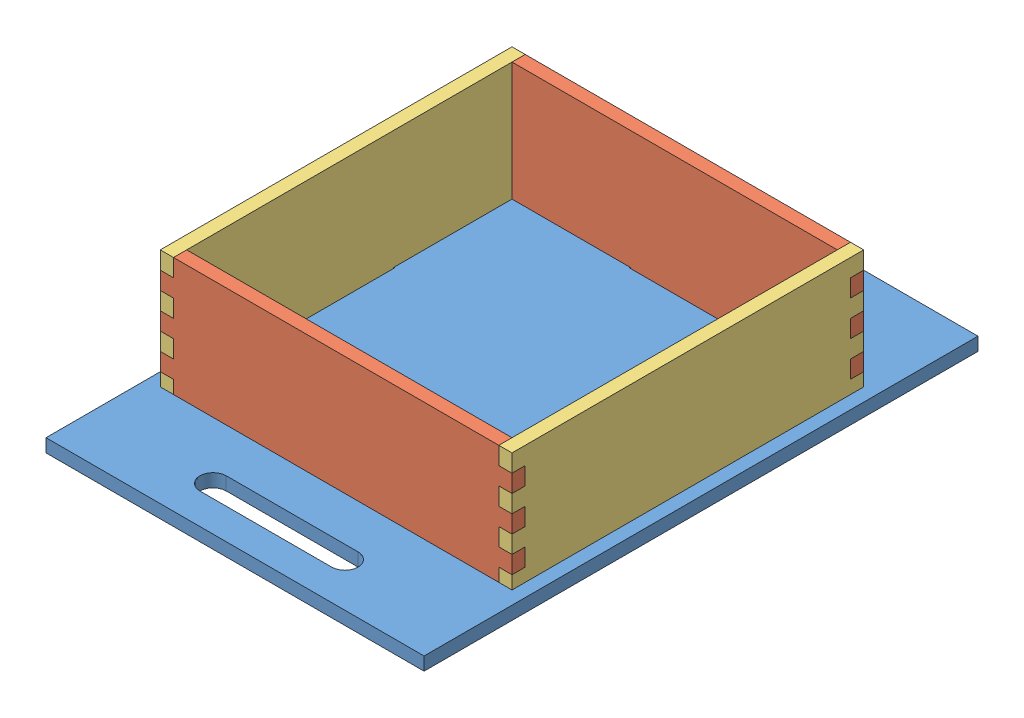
SolidWorks assembly cajon.SLDASM, configuration Predeterminado (file format 9000). Lengths in mm.
Overall size (430 150 630).
5 component instances, 3 part files, 12 mates.
Components (placement in the parent):
- basecajon-1: basecajon.SLDPRT [Predeterminado] at (-41.6731 -10.3719 300) size (430 15 630)
- frontalcajon-1: frontalcajon.SLDPRT [Predeterminado] at (-41.6731 64.6281 485) size (400 150 15)
- lateralcajon-1: lateralcajon.SLDPRT [Predeterminado] at (143.3269 64.6281 300) x (0 0 -1) z (1 0 0) size (400 150 15)
- frontalcajon-2: frontalcajon.SLDPRT [Predeterminado] at (-41.6731 64.6281 100) size (400 150 15)
- lateralcajon-2: lateralcajon.SLDPRT [Predeterminado] at (-226.6731 64.6281 300) x (0 0 1) z (-1 0 0) size (400 150 15)
Mates (geometry in assembly coordinates):
- Coincidente1: coincident aligned: plane of frontalcajon-1 through (158.3269 4.6281 500) normal (1 0 0); plane of lateralcajon-1 through (158.3269 64.6281 300) normal (1 0 0)
- Coincidente3: coincident aligned: plane of frontalcajon-1 through (158.3269 139.6281 500) normal (0 1 0); plane of lateralcajon-1 through (158.3269 139.6281 100) normal (0 1 0)
- Coincidente4: coincident aligned: plane of basecajon-1 through (-41.6731 -10.3719 300) normal (0 -1 0); plane of frontalcajon-1 through (8.3269 -10.3719 500) normal (0 -1 0)
- Coincidente5: coincident anti-aligned: plane of basecajon-1 through (-92.1731 4.6281 500) normal (0 0 -1); plane of frontalcajon-1 through (-41.6731 64.6281 500) normal (0 0 1)
- Coincidente6: coincident anti-aligned: plane of basecajon-1 through (158.3269 4.6281 249.5) normal (-1 0 0); plane of lateralcajon-1 through (158.3269 64.6281 300) normal (1 0 0)
- Coincidente7: coincident aligned: plane of basecajon-1 through (-41.6731 -10.3719 300) normal (0 -1 0); plane of frontalcajon-2 through (8.3269 -10.3719 115) normal (0 -1 0)
- Coincidente8: coincident anti-aligned: plane of basecajon-1 through (-92.1731 4.6281 100) normal (0 0 1); plane of frontalcajon-2 through (-41.6731 64.6281 100) normal (0 0 -1)
- Coincidente9: coincident aligned: plane of frontalcajon-1 through (-41.6731 64.6281 500) normal (0 0 1); plane of lateralcajon-1 through (158.3269 4.6281 500) normal (0 0 1)
- Coincidente10: coincident aligned: plane of lateralcajon-1 through (158.3269 64.6281 300) normal (1 0 0); plane of frontalcajon-2 through (158.3269 4.6281 115) normal (1 0 0)
- Coincidente11: coincident anti-aligned: plane of basecajon-1 through (-241.6731 4.6281 249.5) normal (1 0 0); plane of lateralcajon-2 through (-241.6731 64.6281 300) normal (-1 0 0)
- Coincidente12: coincident aligned: plane of basecajon-1 through (-41.6731 -10.3719 300) normal (0 -1 0); plane of lateralcajon-2 through (-241.6731 -10.3719 250) normal (0 -1 0)
- Coincidente13: coincident aligned: plane of frontalcajon-1 through (-41.6731 64.6281 500) normal (0 0 1); plane of lateralcajon-2 through (-241.6731 4.6281 500) normal (0 0 1)
